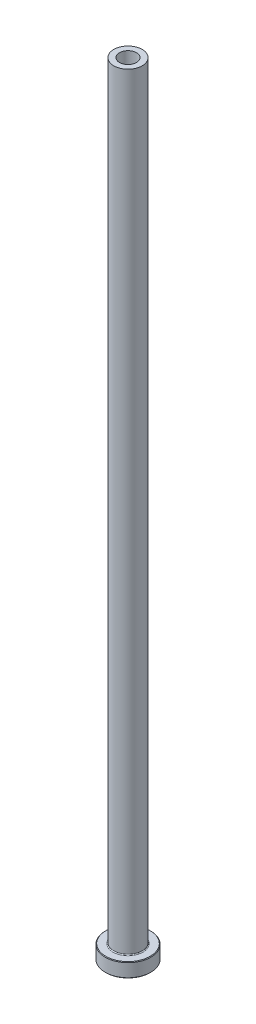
ISO-10303-21;
HEADER;
FILE_DESCRIPTION(('STEP AP214'),'2;1');
FILE_NAME('part.step','',(''),(''),'','','');
FILE_SCHEMA(('AUTOMOTIVE_DESIGN { 1 0 10303 214 1 1 1 1 }'));
ENDSEC;
DATA;
#1=APPLICATION_CONTEXT('core data for automotive mechanical design processes');
#2=APPLICATION_PROTOCOL_DEFINITION('international standard','automotive_design',2000,#1);
#3=PRODUCT_CONTEXT('',#1,'mechanical');
#4=PRODUCT('Part','Part','',(#3));
#5=PRODUCT_RELATED_PRODUCT_CATEGORY('part','',(#4));
#6=PRODUCT_DEFINITION_FORMATION('','',#4);
#7=PRODUCT_DEFINITION_CONTEXT('part definition',#1,'design');
#8=PRODUCT_DEFINITION('design','',#6,#7);
#9=PRODUCT_DEFINITION_SHAPE('','',#8);
#10=(LENGTH_UNIT() NAMED_UNIT(*) SI_UNIT(.MILLI.,.METRE.));
#11=(NAMED_UNIT(*) PLANE_ANGLE_UNIT() SI_UNIT($,.RADIAN.));
#12=(NAMED_UNIT(*) SI_UNIT($,.STERADIAN.) SOLID_ANGLE_UNIT());
#13=UNCERTAINTY_MEASURE_WITH_UNIT(LENGTH_MEASURE(1.E-05),#10,'distance_accuracy_value','');
#14=(GEOMETRIC_REPRESENTATION_CONTEXT(3) GLOBAL_UNCERTAINTY_ASSIGNED_CONTEXT((#13)) GLOBAL_UNIT_ASSIGNED_CONTEXT((#10,
#11,#12)) REPRESENTATION_CONTEXT('',''));
#15=CARTESIAN_POINT('',(0.,0.,0.));
#16=DIRECTION('',(0.,0.,1.));
#17=DIRECTION('',(1.,0.,0.));
#18=AXIS2_PLACEMENT_3D('',#15,#16,#17);
#19=CARTESIAN_POINT('',(0.,92.1876809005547,0.));
#20=DIRECTION('',(0.,1.,0.));
#21=DIRECTION('',(0.,0.,1.));
#22=AXIS2_PLACEMENT_3D('',#19,#20,#21);
#23=CYLINDRICAL_SURFACE('',#22,3.00000000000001);
#24=CARTESIAN_POINT('',(0.,275.,0.));
#25=DIRECTION('',(0.,1.,0.));
#26=DIRECTION('',(0.,0.,1.));
#27=AXIS2_PLACEMENT_3D('',#24,#25,#26);
#28=CIRCLE('',#27,3.00000000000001);
#29=CARTESIAN_POINT('',(0.,275.,3.00000000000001));
#30=VERTEX_POINT('',#29);
#31=EDGE_CURVE('E62',#30,#30,#28,.T.);
#32=ORIENTED_EDGE('',*,*,#31,.T.);
#33=EDGE_LOOP('',(#32));
#34=FACE_BOUND('',#33,.T.);
#35=CARTESIAN_POINT('',(0.,230.,0.));
#36=DIRECTION('',(0.,1.,0.));
#37=DIRECTION('',(0.,0.,1.));
#38=AXIS2_PLACEMENT_3D('',#35,#36,#37);
#39=CIRCLE('',#38,3.00000000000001);
#40=CARTESIAN_POINT('',(0.,230.,3.00000000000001));
#41=VERTEX_POINT('',#40);
#42=EDGE_CURVE('E71',#41,#41,#39,.T.);
#43=ORIENTED_EDGE('',*,*,#42,.F.);
#44=EDGE_LOOP('',(#43));
#45=FACE_BOUND('',#44,.T.);
#46=ADVANCED_FACE('F30',(#34,#45),#23,.F.);
#47=CARTESIAN_POINT('',(-3.00000000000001,275.,0.));
#48=DIRECTION('',(0.,1.,0.));
#49=DIRECTION('',(0.,0.,1.));
#50=AXIS2_PLACEMENT_3D('',#47,#48,#49);
#51=PLANE('',#50);
#52=CARTESIAN_POINT('',(0.,275.,0.));
#53=DIRECTION('',(0.,1.,0.));
#54=DIRECTION('',(0.,0.,1.));
#55=AXIS2_PLACEMENT_3D('',#52,#53,#54);
#56=CIRCLE('',#55,5.00000000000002);
#57=CARTESIAN_POINT('',(0.,275.,5.00000000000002));
#58=VERTEX_POINT('',#57);
#59=EDGE_CURVE('E65',#58,#58,#56,.T.);
#60=ORIENTED_EDGE('',*,*,#59,.T.);
#61=EDGE_LOOP('',(#60));
#62=FACE_BOUND('',#61,.T.);
#63=ORIENTED_EDGE('',*,*,#31,.F.);
#64=EDGE_LOOP('',(#63));
#65=FACE_BOUND('',#64,.T.);
#66=ADVANCED_FACE('F79',(#62,#65),#51,.T.);
#67=CARTESIAN_POINT('',(0.,92.1876809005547,0.));
#68=DIRECTION('',(0.,1.,0.));
#69=DIRECTION('',(0.,0.,1.));
#70=AXIS2_PLACEMENT_3D('',#67,#68,#69);
#71=CYLINDRICAL_SURFACE('',#70,5.00000000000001);
#72=CARTESIAN_POINT('',(0.,5.3,0.));
#73=DIRECTION('',(0.,1.,0.));
#74=DIRECTION('',(0.,0.,1.));
#75=AXIS2_PLACEMENT_3D('',#72,#73,#74);
#76=CIRCLE('',#75,5.00000000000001);
#77=CARTESIAN_POINT('',(0.,5.3,5.00000000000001));
#78=VERTEX_POINT('',#77);
#79=EDGE_CURVE('E59',#78,#78,#76,.T.);
#80=ORIENTED_EDGE('',*,*,#79,.T.);
#81=EDGE_LOOP('',(#80));
#82=FACE_BOUND('',#81,.T.);
#83=ORIENTED_EDGE('',*,*,#59,.F.);
#84=EDGE_LOOP('',(#83));
#85=FACE_BOUND('',#84,.T.);
#86=ADVANCED_FACE('F85',(#82,#85),#71,.T.);
#87=CARTESIAN_POINT('',(-4.99999999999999,5.,0.));
#88=DIRECTION('',(0.,1.,0.));
#89=DIRECTION('',(0.,0.,1.));
#90=AXIS2_PLACEMENT_3D('',#87,#88,#89);
#91=PLANE('',#90);
#92=CARTESIAN_POINT('',(0.,5.,0.));
#93=DIRECTION('',(0.,1.,0.));
#94=DIRECTION('',(0.,0.,1.));
#95=AXIS2_PLACEMENT_3D('',#92,#93,#94);
#96=CIRCLE('',#95,7.80000000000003);
#97=CARTESIAN_POINT('',(0.,5.,7.80000000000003));
#98=VERTEX_POINT('',#97);
#99=EDGE_CURVE('E53',#98,#98,#96,.T.);
#100=ORIENTED_EDGE('',*,*,#99,.T.);
#101=EDGE_LOOP('',(#100));
#102=FACE_BOUND('',#101,.T.);
#103=CARTESIAN_POINT('',(0.,5.,0.));
#104=DIRECTION('',(0.,1.,0.));
#105=DIRECTION('',(0.,0.,1.));
#106=AXIS2_PLACEMENT_3D('',#103,#104,#105);
#107=CIRCLE('',#106,5.30000000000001);
#108=CARTESIAN_POINT('',(0.,5.,5.30000000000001));
#109=VERTEX_POINT('',#108);
#110=EDGE_CURVE('E56',#109,#109,#107,.F.);
#111=ORIENTED_EDGE('',*,*,#110,.T.);
#112=EDGE_LOOP('',(#111));
#113=FACE_BOUND('',#112,.T.);
#114=ADVANCED_FACE('F111',(#102,#113),#91,.T.);
#115=CARTESIAN_POINT('',(0.,92.1876809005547,0.));
#116=DIRECTION('',(0.,1.,0.));
#117=DIRECTION('',(0.,0.,1.));
#118=AXIS2_PLACEMENT_3D('',#115,#116,#117);
#119=CYLINDRICAL_SURFACE('',#118,7.99999999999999);
#120=CARTESIAN_POINT('',(0.,4.80000000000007,0.));
#121=DIRECTION('',(0.,1.,0.));
#122=DIRECTION('',(0.,0.,1.));
#123=AXIS2_PLACEMENT_3D('',#120,#121,#122);
#124=CIRCLE('',#123,7.99999999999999);
#125=CARTESIAN_POINT('',(0.,4.80000000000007,7.99999999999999));
#126=VERTEX_POINT('',#125);
#127=EDGE_CURVE('E45',#126,#126,#124,.F.);
#128=ORIENTED_EDGE('',*,*,#127,.T.);
#129=EDGE_LOOP('',(#128));
#130=FACE_BOUND('',#129,.T.);
#131=CARTESIAN_POINT('',(0.,0.200000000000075,0.));
#132=DIRECTION('',(0.,-1.,0.));
#133=DIRECTION('',(0.,0.,-1.));
#134=AXIS2_PLACEMENT_3D('',#131,#132,#133);
#135=CIRCLE('',#134,7.99999999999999);
#136=CARTESIAN_POINT('',(0.,0.200000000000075,-7.99999999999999));
#137=VERTEX_POINT('',#136);
#138=EDGE_CURVE('E50',#137,#137,#135,.F.);
#139=ORIENTED_EDGE('',*,*,#138,.T.);
#140=EDGE_LOOP('',(#139));
#141=FACE_BOUND('',#140,.T.);
#142=ADVANCED_FACE('F108',(#130,#141),#119,.T.);
#143=CARTESIAN_POINT('',(-7.99999999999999,0.,0.));
#144=DIRECTION('',(0.,-1.,0.));
#145=DIRECTION('',(0.,0.,-1.));
#146=AXIS2_PLACEMENT_3D('',#143,#144,#145);
#147=PLANE('',#146);
#148=CARTESIAN_POINT('',(0.,0.,0.));
#149=DIRECTION('',(0.,-1.,0.));
#150=DIRECTION('',(0.,0.,-1.));
#151=AXIS2_PLACEMENT_3D('',#148,#149,#150);
#152=CIRCLE('',#151,3.75);
#153=CARTESIAN_POINT('',(0.,0.,-3.75));
#154=VERTEX_POINT('',#153);
#155=EDGE_CURVE('E37',#154,#154,#152,.F.);
#156=ORIENTED_EDGE('',*,*,#155,.T.);
#157=EDGE_LOOP('',(#156));
#158=FACE_BOUND('',#157,.T.);
#159=CARTESIAN_POINT('',(0.,0.,0.));
#160=DIRECTION('',(0.,-1.,0.));
#161=DIRECTION('',(0.,0.,-1.));
#162=AXIS2_PLACEMENT_3D('',#159,#160,#161);
#163=CIRCLE('',#162,7.79999999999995);
#164=CARTESIAN_POINT('',(0.,0.,-7.79999999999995));
#165=VERTEX_POINT('',#164);
#166=EDGE_CURVE('E41',#165,#165,#163,.T.);
#167=ORIENTED_EDGE('',*,*,#166,.T.);
#168=EDGE_LOOP('',(#167));
#169=FACE_BOUND('',#168,.T.);
#170=ADVANCED_FACE('F110',(#158,#169),#147,.T.);
#171=CARTESIAN_POINT('',(0.,92.1876809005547,0.));
#172=DIRECTION('',(0.,1.,0.));
#173=DIRECTION('',(0.,0.,1.));
#174=AXIS2_PLACEMENT_3D('',#171,#172,#173);
#175=CYLINDRICAL_SURFACE('',#174,3.25);
#176=CARTESIAN_POINT('',(0.,0.499999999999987,0.));
#177=DIRECTION('',(0.,-1.,0.));
#178=DIRECTION('',(0.,0.,-1.));
#179=AXIS2_PLACEMENT_3D('',#176,#177,#178);
#180=CIRCLE('',#179,3.25);
#181=CARTESIAN_POINT('',(0.,0.499999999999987,-3.25));
#182=VERTEX_POINT('',#181);
#183=EDGE_CURVE('E10',#182,#182,#180,.T.);
#184=ORIENTED_EDGE('',*,*,#183,.T.);
#185=EDGE_LOOP('',(#184));
#186=FACE_BOUND('',#185,.T.);
#187=CARTESIAN_POINT('',(0.,218.,0.));
#188=DIRECTION('',(0.,1.,0.));
#189=DIRECTION('',(0.,0.,1.));
#190=AXIS2_PLACEMENT_3D('',#187,#188,#189);
#191=CIRCLE('',#190,3.25000000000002);
#192=CARTESIAN_POINT('',(0.,218.,3.25000000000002));
#193=VERTEX_POINT('',#192);
#194=EDGE_CURVE('E68',#193,#193,#191,.T.);
#195=ORIENTED_EDGE('',*,*,#194,.T.);
#196=EDGE_LOOP('',(#195));
#197=FACE_BOUND('',#196,.T.);
#198=ADVANCED_FACE('F118',(#186,#197),#175,.F.);
#199=CARTESIAN_POINT('',(0.,218.,0.));
#200=DIRECTION('',(0.,-1.,0.));
#201=DIRECTION('',(0.,0.,-1.));
#202=AXIS2_PLACEMENT_3D('',#199,#200,#201);
#203=CONICAL_SURFACE('',#202,3.25000000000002,0.0208303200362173);
#204=ORIENTED_EDGE('',*,*,#42,.T.);
#205=EDGE_LOOP('',(#204));
#206=FACE_BOUND('',#205,.T.);
#207=ORIENTED_EDGE('',*,*,#194,.F.);
#208=EDGE_LOOP('',(#207));
#209=FACE_BOUND('',#208,.T.);
#210=ADVANCED_FACE('F75',(#206,#209),#203,.F.);
#211=CARTESIAN_POINT('',(0.,5.3,0.));
#212=DIRECTION('',(0.,1.,0.));
#213=DIRECTION('',(0.,0.,1.));
#214=AXIS2_PLACEMENT_3D('',#211,#212,#213);
#215=TOROIDAL_SURFACE('',#214,5.30000000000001,0.3);
#216=ORIENTED_EDGE('',*,*,#110,.F.);
#217=EDGE_LOOP('',(#216));
#218=FACE_BOUND('',#217,.T.);
#219=ORIENTED_EDGE('',*,*,#79,.F.);
#220=EDGE_LOOP('',(#219));
#221=FACE_BOUND('',#220,.T.);
#222=ADVANCED_FACE('F90',(#218,#221),#215,.F.);
#223=CARTESIAN_POINT('',(0.,5.,0.));
#224=DIRECTION('',(0.,-1.,0.));
#225=DIRECTION('',(0.,0.,-1.));
#226=AXIS2_PLACEMENT_3D('',#223,#224,#225);
#227=CONICAL_SURFACE('',#226,7.80000000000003,0.785398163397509);
#228=ORIENTED_EDGE('',*,*,#127,.F.);
#229=EDGE_LOOP('',(#228));
#230=FACE_BOUND('',#229,.T.);
#231=ORIENTED_EDGE('',*,*,#99,.F.);
#232=EDGE_LOOP('',(#231));
#233=FACE_BOUND('',#232,.T.);
#234=ADVANCED_FACE('F93',(#230,#233),#227,.T.);
#235=CARTESIAN_POINT('',(0.,0.200000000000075,0.));
#236=DIRECTION('',(0.,1.,0.));
#237=DIRECTION('',(0.,0.,1.));
#238=AXIS2_PLACEMENT_3D('',#235,#236,#237);
#239=CONICAL_SURFACE('',#238,7.99999999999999,0.78539816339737);
#240=ORIENTED_EDGE('',*,*,#166,.F.);
#241=EDGE_LOOP('',(#240));
#242=FACE_BOUND('',#241,.T.);
#243=ORIENTED_EDGE('',*,*,#138,.F.);
#244=EDGE_LOOP('',(#243));
#245=FACE_BOUND('',#244,.T.);
#246=ADVANCED_FACE('F96',(#242,#245),#239,.T.);
#247=CARTESIAN_POINT('',(0.,0.,0.));
#248=DIRECTION('',(0.,-1.,0.));
#249=DIRECTION('',(0.,0.,-1.));
#250=AXIS2_PLACEMENT_3D('',#247,#248,#249);
#251=CONICAL_SURFACE('',#250,3.75,0.785398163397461);
#252=ORIENTED_EDGE('',*,*,#183,.F.);
#253=EDGE_LOOP('',(#252));
#254=FACE_BOUND('',#253,.T.);
#255=ORIENTED_EDGE('',*,*,#155,.F.);
#256=EDGE_LOOP('',(#255));
#257=FACE_BOUND('',#256,.T.);
#258=ADVANCED_FACE('F32',(#254,#257),#251,.F.);
#259=CLOSED_SHELL('',(#46,#66,#86,#114,#142,#170,#198,#210,#222,#234,#246,#258));
#260=MANIFOLD_SOLID_BREP('B2',#259);
#261=ADVANCED_BREP_SHAPE_REPRESENTATION('',(#18,#260),#14);
#262=SHAPE_DEFINITION_REPRESENTATION(#9,#261);
ENDSEC;
END-ISO-10303-21;
